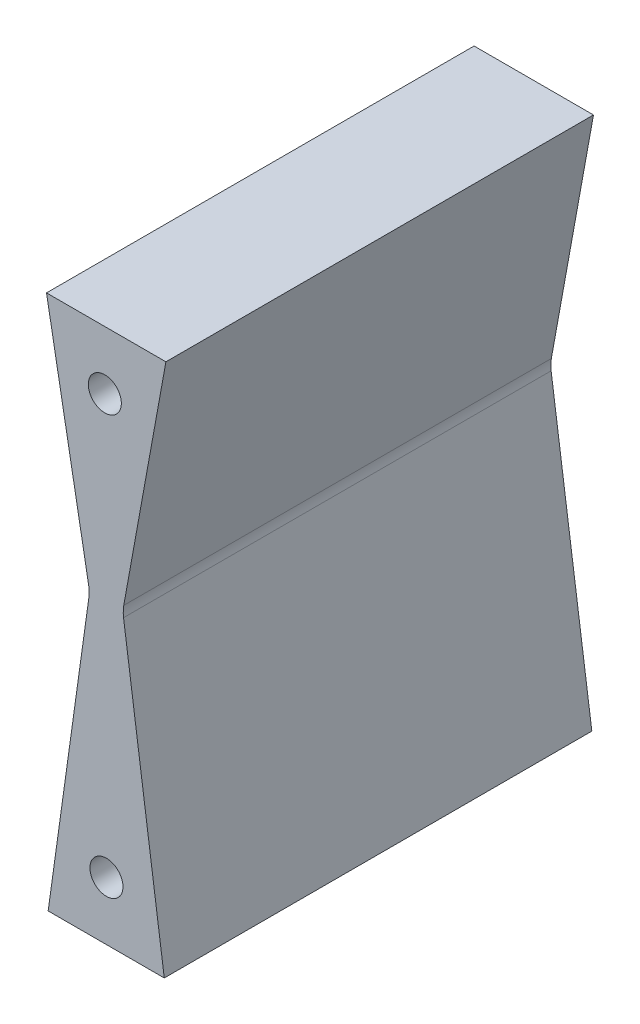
ISO-10303-21;
HEADER;
FILE_DESCRIPTION(('STEP AP214'),'2;1');
FILE_NAME('part.step','',(''),(''),'','','');
FILE_SCHEMA(('AUTOMOTIVE_DESIGN { 1 0 10303 214 1 1 1 1 }'));
ENDSEC;
DATA;
#1=APPLICATION_CONTEXT('core data for automotive mechanical design processes');
#2=APPLICATION_PROTOCOL_DEFINITION('international standard','automotive_design',2000,#1);
#3=PRODUCT_CONTEXT('',#1,'mechanical');
#4=PRODUCT('Part','Part','',(#3));
#5=PRODUCT_RELATED_PRODUCT_CATEGORY('part','',(#4));
#6=PRODUCT_DEFINITION_FORMATION('','',#4);
#7=PRODUCT_DEFINITION_CONTEXT('part definition',#1,'design');
#8=PRODUCT_DEFINITION('design','',#6,#7);
#9=PRODUCT_DEFINITION_SHAPE('','',#8);
#10=(LENGTH_UNIT() NAMED_UNIT(*) SI_UNIT(.MILLI.,.METRE.));
#11=(NAMED_UNIT(*) PLANE_ANGLE_UNIT() SI_UNIT($,.RADIAN.));
#12=(NAMED_UNIT(*) SI_UNIT($,.STERADIAN.) SOLID_ANGLE_UNIT());
#13=UNCERTAINTY_MEASURE_WITH_UNIT(LENGTH_MEASURE(1.E-05),#10,'distance_accuracy_value','');
#14=(GEOMETRIC_REPRESENTATION_CONTEXT(3) GLOBAL_UNCERTAINTY_ASSIGNED_CONTEXT((#13)) GLOBAL_UNIT_ASSIGNED_CONTEXT((#10,
#11,#12)) REPRESENTATION_CONTEXT('',''));
#15=CARTESIAN_POINT('',(0.,0.,0.));
#16=DIRECTION('',(0.,0.,1.));
#17=DIRECTION('',(1.,0.,0.));
#18=AXIS2_PLACEMENT_3D('',#15,#16,#17);
#19=CARTESIAN_POINT('',(-41.9999999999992,-96.5000000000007,-88.));
#20=DIRECTION('',(0.,0.,1.));
#21=DIRECTION('',(1.,0.,0.));
#22=AXIS2_PLACEMENT_3D('',#19,#20,#21);
#23=CYLINDRICAL_SURFACE('',#22,7.00000000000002);
#24=CARTESIAN_POINT('',(-41.9999999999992,-96.5000000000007,0.));
#25=DIRECTION('',(0.,0.,-1.));
#26=DIRECTION('',(1.,0.,0.));
#27=AXIS2_PLACEMENT_3D('',#24,#25,#26);
#28=CIRCLE('',#27,7.00000000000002);
#29=CARTESIAN_POINT('',(-48.9327633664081,-97.4678802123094,0.));
#30=VERTEX_POINT('',#29);
#31=CARTESIAN_POINT('',(-48.8872820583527,-95.2488621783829,0.));
#32=VERTEX_POINT('',#31);
#33=EDGE_CURVE('E122',#30,#32,#28,.T.);
#34=ORIENTED_EDGE('',*,*,#33,.F.);
#35=DIRECTION('',(0.,0.,1.));
#36=VECTOR('',#35,1.);
#37=CARTESIAN_POINT('',(-48.9327633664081,-97.4678802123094,-88.));
#38=LINE('',#37,#36);
#39=CARTESIAN_POINT('',(-48.9327633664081,-97.4678802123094,-88.));
#40=VERTEX_POINT('',#39);
#41=EDGE_CURVE('E11',#40,#30,#38,.T.);
#42=ORIENTED_EDGE('',*,*,#41,.F.);
#43=CARTESIAN_POINT('',(-41.9999999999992,-96.5000000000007,-88.));
#44=DIRECTION('',(0.,0.,-1.));
#45=DIRECTION('',(1.,0.,0.));
#46=AXIS2_PLACEMENT_3D('',#43,#44,#45);
#47=CIRCLE('',#46,7.00000000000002);
#48=CARTESIAN_POINT('',(-48.8872820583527,-95.2488621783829,-88.));
#49=VERTEX_POINT('',#48);
#50=EDGE_CURVE('E146',#40,#49,#47,.T.);
#51=ORIENTED_EDGE('',*,*,#50,.T.);
#52=DIRECTION('',(0.,0.,1.));
#53=VECTOR('',#52,1.);
#54=CARTESIAN_POINT('',(-48.8872820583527,-95.2488621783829,-88.));
#55=LINE('',#54,#53);
#56=EDGE_CURVE('E36',#49,#32,#55,.T.);
#57=ORIENTED_EDGE('',*,*,#56,.T.);
#58=EDGE_LOOP('',(#34,#42,#51,#57));
#59=FACE_BOUND('',#58,.T.);
#60=ADVANCED_FACE('F33',(#59),#23,.F.);
#61=CARTESIAN_POINT('',(-40.5517040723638,-157.500000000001,-88.));
#62=DIRECTION('',(0.990394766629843,0.138268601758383,0.));
#63=DIRECTION('',(-0.138268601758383,0.990394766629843,0.));
#64=AXIS2_PLACEMENT_3D('',#61,#62,#63);
#65=PLANE('',#64);
#66=DIRECTION('',(-0.138268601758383,0.990394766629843,0.));
#67=VECTOR('',#66,1.);
#68=CARTESIAN_POINT('',(-40.5517040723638,-157.500000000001,0.));
#69=LINE('',#68,#67);
#70=CARTESIAN_POINT('',(-40.5517040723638,-157.500000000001,0.));
#71=VERTEX_POINT('',#70);
#72=EDGE_CURVE('E143',#71,#30,#69,.T.);
#73=ORIENTED_EDGE('',*,*,#72,.F.);
#74=DIRECTION('',(0.,0.,1.));
#75=VECTOR('',#74,1.);
#76=CARTESIAN_POINT('',(-40.5517040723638,-157.500000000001,-88.));
#77=LINE('',#76,#75);
#78=CARTESIAN_POINT('',(-40.5517040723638,-157.500000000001,-88.));
#79=VERTEX_POINT('',#78);
#80=EDGE_CURVE('E41',#79,#71,#77,.T.);
#81=ORIENTED_EDGE('',*,*,#80,.F.);
#82=DIRECTION('',(-0.138268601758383,0.990394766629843,0.));
#83=VECTOR('',#82,1.);
#84=CARTESIAN_POINT('',(-40.5517040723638,-157.500000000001,-88.));
#85=LINE('',#84,#83);
#86=EDGE_CURVE('E165',#79,#40,#85,.T.);
#87=ORIENTED_EDGE('',*,*,#86,.T.);
#88=ORIENTED_EDGE('',*,*,#41,.T.);
#89=EDGE_LOOP('',(#73,#81,#87,#88));
#90=FACE_BOUND('',#89,.T.);
#91=ADVANCED_FACE('F184',(#90),#65,.T.);
#92=CARTESIAN_POINT('',(-64.4482959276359,-157.500000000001,-88.));
#93=DIRECTION('',(0.,-1.,0.));
#94=DIRECTION('',(0.,0.,-1.));
#95=AXIS2_PLACEMENT_3D('',#92,#93,#94);
#96=PLANE('',#95);
#97=DIRECTION('',(1.,0.,0.));
#98=VECTOR('',#97,1.);
#99=CARTESIAN_POINT('',(-64.4482959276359,-157.500000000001,0.));
#100=LINE('',#99,#98);
#101=CARTESIAN_POINT('',(-64.4482959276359,-157.500000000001,0.));
#102=VERTEX_POINT('',#101);
#103=EDGE_CURVE('E140',#102,#71,#100,.T.);
#104=ORIENTED_EDGE('',*,*,#103,.F.);
#105=DIRECTION('',(0.,0.,1.));
#106=VECTOR('',#105,1.);
#107=CARTESIAN_POINT('',(-64.4482959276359,-157.500000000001,-88.));
#108=LINE('',#107,#106);
#109=CARTESIAN_POINT('',(-64.4482959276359,-157.500000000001,-88.));
#110=VERTEX_POINT('',#109);
#111=EDGE_CURVE('E168',#110,#102,#108,.T.);
#112=ORIENTED_EDGE('',*,*,#111,.F.);
#113=DIRECTION('',(1.,0.,0.));
#114=VECTOR('',#113,1.);
#115=CARTESIAN_POINT('',(-64.4482959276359,-157.500000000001,-88.));
#116=LINE('',#115,#114);
#117=EDGE_CURVE('E163',#110,#79,#116,.T.);
#118=ORIENTED_EDGE('',*,*,#117,.T.);
#119=ORIENTED_EDGE('',*,*,#80,.T.);
#120=EDGE_LOOP('',(#104,#112,#118,#119));
#121=FACE_BOUND('',#120,.T.);
#122=ADVANCED_FACE('F205',(#121),#96,.T.);
#123=CARTESIAN_POINT('',(-56.0672366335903,-97.4678802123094,-88.));
#124=DIRECTION('',(-0.99039476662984,0.138268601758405,0.));
#125=DIRECTION('',(-0.138268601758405,-0.99039476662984,0.));
#126=AXIS2_PLACEMENT_3D('',#123,#124,#125);
#127=PLANE('',#126);
#128=DIRECTION('',(-0.138268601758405,-0.99039476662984,0.));
#129=VECTOR('',#128,1.);
#130=CARTESIAN_POINT('',(-56.0672366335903,-97.4678802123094,0.));
#131=LINE('',#130,#129);
#132=CARTESIAN_POINT('',(-56.0672366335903,-97.4678802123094,0.));
#133=VERTEX_POINT('',#132);
#134=EDGE_CURVE('E137',#133,#102,#131,.T.);
#135=ORIENTED_EDGE('',*,*,#134,.F.);
#136=DIRECTION('',(0.,0.,1.));
#137=VECTOR('',#136,1.);
#138=CARTESIAN_POINT('',(-56.0672366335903,-97.4678802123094,-88.));
#139=LINE('',#138,#137);
#140=CARTESIAN_POINT('',(-56.0672366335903,-97.4678802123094,-88.));
#141=VERTEX_POINT('',#140);
#142=EDGE_CURVE('E170',#141,#133,#139,.T.);
#143=ORIENTED_EDGE('',*,*,#142,.F.);
#144=DIRECTION('',(-0.138268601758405,-0.99039476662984,0.));
#145=VECTOR('',#144,1.);
#146=CARTESIAN_POINT('',(-56.0672366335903,-97.4678802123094,-88.));
#147=LINE('',#146,#145);
#148=EDGE_CURVE('E160',#141,#110,#147,.T.);
#149=ORIENTED_EDGE('',*,*,#148,.T.);
#150=ORIENTED_EDGE('',*,*,#111,.T.);
#151=EDGE_LOOP('',(#135,#143,#149,#150));
#152=FACE_BOUND('',#151,.T.);
#153=ADVANCED_FACE('F203',(#152),#127,.T.);
#154=CARTESIAN_POINT('',(-62.9999999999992,-96.5000000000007,-88.));
#155=DIRECTION('',(0.,0.,1.));
#156=DIRECTION('',(1.,0.,0.));
#157=AXIS2_PLACEMENT_3D('',#154,#155,#156);
#158=CYLINDRICAL_SURFACE('',#157,6.99999999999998);
#159=CARTESIAN_POINT('',(-62.9999999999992,-96.5000000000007,0.));
#160=DIRECTION('',(0.,0.,-1.));
#161=DIRECTION('',(1.,0.,0.));
#162=AXIS2_PLACEMENT_3D('',#159,#160,#161);
#163=CIRCLE('',#162,6.99999999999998);
#164=CARTESIAN_POINT('',(-56.1127179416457,-95.2488621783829,0.));
#165=VERTEX_POINT('',#164);
#166=EDGE_CURVE('E134',#165,#133,#163,.T.);
#167=ORIENTED_EDGE('',*,*,#166,.F.);
#168=DIRECTION('',(0.,0.,1.));
#169=VECTOR('',#168,1.);
#170=CARTESIAN_POINT('',(-56.1127179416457,-95.2488621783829,-88.));
#171=LINE('',#170,#169);
#172=CARTESIAN_POINT('',(-56.1127179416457,-95.2488621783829,-88.));
#173=VERTEX_POINT('',#172);
#174=EDGE_CURVE('E172',#173,#165,#171,.T.);
#175=ORIENTED_EDGE('',*,*,#174,.F.);
#176=CARTESIAN_POINT('',(-62.9999999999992,-96.5000000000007,-88.));
#177=DIRECTION('',(0.,0.,-1.));
#178=DIRECTION('',(1.,0.,0.));
#179=AXIS2_PLACEMENT_3D('',#176,#177,#178);
#180=CIRCLE('',#179,6.99999999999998);
#181=EDGE_CURVE('E157',#173,#141,#180,.T.);
#182=ORIENTED_EDGE('',*,*,#181,.T.);
#183=ORIENTED_EDGE('',*,*,#142,.T.);
#184=EDGE_LOOP('',(#167,#175,#182,#183));
#185=FACE_BOUND('',#184,.T.);
#186=ADVANCED_FACE('F200',(#185),#158,.F.);
#187=CARTESIAN_POINT('',(-64.7867357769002,-47.5000000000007,-88.));
#188=DIRECTION('',(-0.983897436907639,-0.178733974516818,0.));
#189=DIRECTION('',(0.178733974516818,-0.983897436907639,0.));
#190=AXIS2_PLACEMENT_3D('',#187,#188,#189);
#191=PLANE('',#190);
#192=DIRECTION('',(0.178733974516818,-0.983897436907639,0.));
#193=VECTOR('',#192,1.);
#194=CARTESIAN_POINT('',(-64.7867357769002,-47.5000000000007,0.));
#195=LINE('',#194,#193);
#196=CARTESIAN_POINT('',(-64.7867357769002,-47.5000000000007,0.));
#197=VERTEX_POINT('',#196);
#198=EDGE_CURVE('E131',#197,#165,#195,.T.);
#199=ORIENTED_EDGE('',*,*,#198,.F.);
#200=DIRECTION('',(0.,0.,1.));
#201=VECTOR('',#200,1.);
#202=CARTESIAN_POINT('',(-64.7867357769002,-47.5000000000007,-88.));
#203=LINE('',#202,#201);
#204=CARTESIAN_POINT('',(-64.7867357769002,-47.5000000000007,-88.));
#205=VERTEX_POINT('',#204);
#206=EDGE_CURVE('E174',#205,#197,#203,.T.);
#207=ORIENTED_EDGE('',*,*,#206,.F.);
#208=DIRECTION('',(0.178733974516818,-0.983897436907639,0.));
#209=VECTOR('',#208,1.);
#210=CARTESIAN_POINT('',(-64.7867357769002,-47.5000000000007,-88.));
#211=LINE('',#210,#209);
#212=EDGE_CURVE('E154',#205,#173,#211,.T.);
#213=ORIENTED_EDGE('',*,*,#212,.T.);
#214=ORIENTED_EDGE('',*,*,#174,.T.);
#215=EDGE_LOOP('',(#199,#207,#213,#214));
#216=FACE_BOUND('',#215,.T.);
#217=ADVANCED_FACE('F198',(#216),#191,.T.);
#218=CARTESIAN_POINT('',(-40.2132642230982,-47.5000000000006,-88.));
#219=DIRECTION('',(0.,1.,0.));
#220=DIRECTION('',(-1.,0.,0.));
#221=AXIS2_PLACEMENT_3D('',#218,#219,#220);
#222=PLANE('',#221);
#223=DIRECTION('',(-1.,0.,0.));
#224=VECTOR('',#223,1.);
#225=CARTESIAN_POINT('',(-40.2132642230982,-47.5000000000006,0.));
#226=LINE('',#225,#224);
#227=CARTESIAN_POINT('',(-40.2132642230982,-47.5000000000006,0.));
#228=VERTEX_POINT('',#227);
#229=EDGE_CURVE('E128',#228,#197,#226,.T.);
#230=ORIENTED_EDGE('',*,*,#229,.F.);
#231=DIRECTION('',(0.,0.,1.));
#232=VECTOR('',#231,1.);
#233=CARTESIAN_POINT('',(-40.2132642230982,-47.5000000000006,-88.));
#234=LINE('',#233,#232);
#235=CARTESIAN_POINT('',(-40.2132642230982,-47.5000000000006,-88.));
#236=VERTEX_POINT('',#235);
#237=EDGE_CURVE('E175',#236,#228,#234,.T.);
#238=ORIENTED_EDGE('',*,*,#237,.F.);
#239=DIRECTION('',(-1.,0.,0.));
#240=VECTOR('',#239,1.);
#241=CARTESIAN_POINT('',(-40.2132642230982,-47.5000000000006,-88.));
#242=LINE('',#241,#240);
#243=EDGE_CURVE('E151',#236,#205,#242,.T.);
#244=ORIENTED_EDGE('',*,*,#243,.T.);
#245=ORIENTED_EDGE('',*,*,#206,.T.);
#246=EDGE_LOOP('',(#230,#238,#244,#245));
#247=FACE_BOUND('',#246,.T.);
#248=ADVANCED_FACE('F194',(#247),#222,.T.);
#249=CARTESIAN_POINT('',(-48.8872820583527,-95.2488621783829,-88.));
#250=DIRECTION('',(0.983897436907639,-0.178733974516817,0.));
#251=DIRECTION('',(0.178733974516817,0.983897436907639,0.));
#252=AXIS2_PLACEMENT_3D('',#249,#250,#251);
#253=PLANE('',#252);
#254=DIRECTION('',(0.178733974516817,0.983897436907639,0.));
#255=VECTOR('',#254,1.);
#256=CARTESIAN_POINT('',(-48.8872820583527,-95.2488621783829,0.));
#257=LINE('',#256,#255);
#258=EDGE_CURVE('E125',#32,#228,#257,.T.);
#259=ORIENTED_EDGE('',*,*,#258,.F.);
#260=ORIENTED_EDGE('',*,*,#56,.F.);
#261=DIRECTION('',(0.178733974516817,0.983897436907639,0.));
#262=VECTOR('',#261,1.);
#263=CARTESIAN_POINT('',(-48.8872820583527,-95.2488621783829,-88.));
#264=LINE('',#263,#262);
#265=EDGE_CURVE('E148',#49,#236,#264,.T.);
#266=ORIENTED_EDGE('',*,*,#265,.T.);
#267=ORIENTED_EDGE('',*,*,#237,.T.);
#268=EDGE_LOOP('',(#259,#260,#266,#267));
#269=FACE_BOUND('',#268,.T.);
#270=ADVANCED_FACE('F180',(#269),#253,.T.);
#271=CARTESIAN_POINT('',(-41.9999999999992,-96.5000000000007,-88.));
#272=DIRECTION('',(0.,0.,1.));
#273=DIRECTION('',(1.,0.,0.));
#274=AXIS2_PLACEMENT_3D('',#271,#272,#273);
#275=PLANE('',#274);
#276=ORIENTED_EDGE('',*,*,#50,.F.);
#277=ORIENTED_EDGE('',*,*,#86,.F.);
#278=ORIENTED_EDGE('',*,*,#117,.F.);
#279=ORIENTED_EDGE('',*,*,#148,.F.);
#280=ORIENTED_EDGE('',*,*,#181,.F.);
#281=ORIENTED_EDGE('',*,*,#212,.F.);
#282=ORIENTED_EDGE('',*,*,#243,.F.);
#283=ORIENTED_EDGE('',*,*,#265,.F.);
#284=EDGE_LOOP('',(#276,#277,#278,#279,#280,#281,#282,#283));
#285=FACE_BOUND('',#284,.T.);
#286=ADVANCED_FACE('F188',(#285),#275,.F.);
#287=CARTESIAN_POINT('',(-41.9999999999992,-96.5000000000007,0.));
#288=DIRECTION('',(0.,0.,1.));
#289=DIRECTION('',(1.,0.,0.));
#290=AXIS2_PLACEMENT_3D('',#287,#288,#289);
#291=PLANE('',#290);
#292=CARTESIAN_POINT('',(-52.7867357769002,-59.5000000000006,0.));
#293=DIRECTION('',(0.,0.,1.));
#294=DIRECTION('',(1.,0.,0.));
#295=AXIS2_PLACEMENT_3D('',#292,#293,#294);
#296=CIRCLE('',#295,3.39999999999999);
#297=CARTESIAN_POINT('',(-49.3867357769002,-59.5000000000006,0.));
#298=VERTEX_POINT('',#297);
#299=EDGE_CURVE('E111',#298,#298,#296,.T.);
#300=ORIENTED_EDGE('',*,*,#299,.F.);
#301=EDGE_LOOP('',(#300));
#302=FACE_BOUND('',#301,.T.);
#303=CARTESIAN_POINT('',(-52.4482959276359,-145.500000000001,0.));
#304=DIRECTION('',(0.,0.,1.));
#305=DIRECTION('',(1.,0.,0.));
#306=AXIS2_PLACEMENT_3D('',#303,#304,#305);
#307=CIRCLE('',#306,3.39999999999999);
#308=CARTESIAN_POINT('',(-49.0482959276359,-145.500000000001,0.));
#309=VERTEX_POINT('',#308);
#310=EDGE_CURVE('E119',#309,#309,#307,.T.);
#311=ORIENTED_EDGE('',*,*,#310,.F.);
#312=EDGE_LOOP('',(#311));
#313=FACE_BOUND('',#312,.T.);
#314=ORIENTED_EDGE('',*,*,#33,.T.);
#315=ORIENTED_EDGE('',*,*,#258,.T.);
#316=ORIENTED_EDGE('',*,*,#229,.T.);
#317=ORIENTED_EDGE('',*,*,#198,.T.);
#318=ORIENTED_EDGE('',*,*,#166,.T.);
#319=ORIENTED_EDGE('',*,*,#134,.T.);
#320=ORIENTED_EDGE('',*,*,#103,.T.);
#321=ORIENTED_EDGE('',*,*,#72,.T.);
#322=EDGE_LOOP('',(#314,#315,#316,#317,#318,#319,#320,#321));
#323=FACE_BOUND('',#322,.T.);
#324=ADVANCED_FACE('F182',(#302,#313,#323),#291,.T.);
#325=CARTESIAN_POINT('',(-52.4482959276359,-145.500000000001,0.));
#326=DIRECTION('',(0.,0.,1.));
#327=DIRECTION('',(1.,0.,0.));
#328=AXIS2_PLACEMENT_3D('',#325,#326,#327);
#329=CYLINDRICAL_SURFACE('',#328,3.39999999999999);
#330=CARTESIAN_POINT('',(-52.4482959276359,-145.500000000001,-30.));
#331=DIRECTION('',(0.,0.,1.));
#332=DIRECTION('',(1.,0.,0.));
#333=AXIS2_PLACEMENT_3D('',#330,#331,#332);
#334=CIRCLE('',#333,3.39999999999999);
#335=CARTESIAN_POINT('',(-49.0482959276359,-145.500000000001,-30.));
#336=VERTEX_POINT('',#335);
#337=EDGE_CURVE('E114',#336,#336,#334,.T.);
#338=ORIENTED_EDGE('',*,*,#337,.F.);
#339=EDGE_LOOP('',(#338));
#340=FACE_BOUND('',#339,.T.);
#341=ORIENTED_EDGE('',*,*,#310,.T.);
#342=EDGE_LOOP('',(#341));
#343=FACE_BOUND('',#342,.T.);
#344=ADVANCED_FACE('F279',(#340,#343),#329,.F.);
#345=CARTESIAN_POINT('',(-52.4482959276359,-145.500000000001,-30.));
#346=DIRECTION('',(0.,0.,1.));
#347=DIRECTION('',(1.,0.,0.));
#348=AXIS2_PLACEMENT_3D('',#345,#346,#347);
#349=CONICAL_SURFACE('',#348,3.39999999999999,1.02974425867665);
#350=CARTESIAN_POINT('',(-52.4482959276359,-145.500000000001,-32.0429261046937));
#351=VERTEX_POINT('',#350);
#352=VERTEX_LOOP('',#351);
#353=FACE_BOUND('',#352,.T.);
#354=ORIENTED_EDGE('',*,*,#337,.T.);
#355=EDGE_LOOP('',(#354));
#356=FACE_BOUND('',#355,.T.);
#357=ADVANCED_FACE('F290',(#353,#356),#349,.F.);
#358=CARTESIAN_POINT('',(-52.7867357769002,-59.5000000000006,0.));
#359=DIRECTION('',(0.,0.,1.));
#360=DIRECTION('',(1.,0.,0.));
#361=AXIS2_PLACEMENT_3D('',#358,#359,#360);
#362=CYLINDRICAL_SURFACE('',#361,3.39999999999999);
#363=CARTESIAN_POINT('',(-52.7867357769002,-59.5000000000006,-30.));
#364=DIRECTION('',(0.,0.,1.));
#365=DIRECTION('',(1.,0.,0.));
#366=AXIS2_PLACEMENT_3D('',#363,#364,#365);
#367=CIRCLE('',#366,3.39999999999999);
#368=CARTESIAN_POINT('',(-49.3867357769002,-59.5000000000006,-30.));
#369=VERTEX_POINT('',#368);
#370=EDGE_CURVE('E109',#369,#369,#367,.T.);
#371=ORIENTED_EDGE('',*,*,#370,.F.);
#372=EDGE_LOOP('',(#371));
#373=FACE_BOUND('',#372,.T.);
#374=ORIENTED_EDGE('',*,*,#299,.T.);
#375=EDGE_LOOP('',(#374));
#376=FACE_BOUND('',#375,.T.);
#377=ADVANCED_FACE('F105',(#373,#376),#362,.F.);
#378=CARTESIAN_POINT('',(-52.7867357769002,-59.5000000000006,-30.));
#379=DIRECTION('',(0.,0.,1.));
#380=DIRECTION('',(1.,0.,0.));
#381=AXIS2_PLACEMENT_3D('',#378,#379,#380);
#382=CONICAL_SURFACE('',#381,3.39999999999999,1.02974425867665);
#383=CARTESIAN_POINT('',(-52.7867357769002,-59.5000000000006,-32.0429261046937));
#384=VERTEX_POINT('',#383);
#385=VERTEX_LOOP('',#384);
#386=FACE_BOUND('',#385,.T.);
#387=ORIENTED_EDGE('',*,*,#370,.T.);
#388=EDGE_LOOP('',(#387));
#389=FACE_BOUND('',#388,.T.);
#390=ADVANCED_FACE('F102',(#386,#389),#382,.F.);
#391=CLOSED_SHELL('',(#60,#91,#122,#153,#186,#217,#248,#270,#286,#324,#344,#357,#377,#390));
#392=MANIFOLD_SOLID_BREP('B2',#391);
#393=ADVANCED_BREP_SHAPE_REPRESENTATION('',(#18,#392),#14);
#394=SHAPE_DEFINITION_REPRESENTATION(#9,#393);
ENDSEC;
END-ISO-10303-21;
